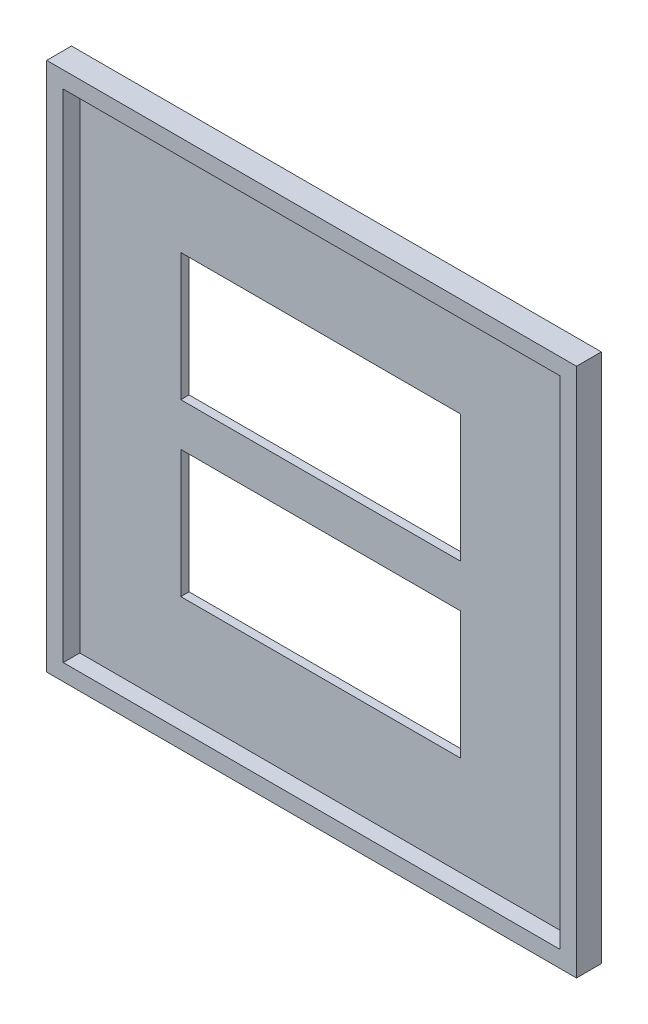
ISO-10303-21;
HEADER;
FILE_DESCRIPTION(('STEP AP214'),'2;1');
FILE_NAME('part.step','',(''),(''),'','','');
FILE_SCHEMA(('AUTOMOTIVE_DESIGN { 1 0 10303 214 1 1 1 1 }'));
ENDSEC;
DATA;
#1=APPLICATION_CONTEXT('core data for automotive mechanical design processes');
#2=APPLICATION_PROTOCOL_DEFINITION('international standard','automotive_design',2000,#1);
#3=PRODUCT_CONTEXT('',#1,'mechanical');
#4=PRODUCT('Part','Part','',(#3));
#5=PRODUCT_RELATED_PRODUCT_CATEGORY('part','',(#4));
#6=PRODUCT_DEFINITION_FORMATION('','',#4);
#7=PRODUCT_DEFINITION_CONTEXT('part definition',#1,'design');
#8=PRODUCT_DEFINITION('design','',#6,#7);
#9=PRODUCT_DEFINITION_SHAPE('','',#8);
#10=(LENGTH_UNIT() NAMED_UNIT(*) SI_UNIT(.MILLI.,.METRE.));
#11=(NAMED_UNIT(*) PLANE_ANGLE_UNIT() SI_UNIT($,.RADIAN.));
#12=(NAMED_UNIT(*) SI_UNIT($,.STERADIAN.) SOLID_ANGLE_UNIT());
#13=UNCERTAINTY_MEASURE_WITH_UNIT(LENGTH_MEASURE(1.E-05),#10,'distance_accuracy_value','');
#14=(GEOMETRIC_REPRESENTATION_CONTEXT(3) GLOBAL_UNCERTAINTY_ASSIGNED_CONTEXT((#13)) GLOBAL_UNIT_ASSIGNED_CONTEXT((#10,
#11,#12)) REPRESENTATION_CONTEXT('',''));
#15=CARTESIAN_POINT('',(0.,0.,0.));
#16=DIRECTION('',(0.,0.,1.));
#17=DIRECTION('',(1.,0.,0.));
#18=AXIS2_PLACEMENT_3D('',#15,#16,#17);
#19=CARTESIAN_POINT('',(40.64,-40.64,3.81));
#20=DIRECTION('',(-1.,0.,0.));
#21=DIRECTION('',(0.,0.,1.));
#22=AXIS2_PLACEMENT_3D('',#19,#20,#21);
#23=PLANE('',#22);
#24=DIRECTION('',(0.,1.,0.));
#25=VECTOR('',#24,1.);
#26=CARTESIAN_POINT('',(40.64,-40.64,0.));
#27=LINE('',#26,#25);
#28=CARTESIAN_POINT('',(40.64,-40.64,0.));
#29=VERTEX_POINT('',#28);
#30=CARTESIAN_POINT('',(40.64,40.64,0.));
#31=VERTEX_POINT('',#30);
#32=EDGE_CURVE('E228',#29,#31,#27,.T.);
#33=ORIENTED_EDGE('',*,*,#32,.T.);
#34=DIRECTION('',(0.,0.,-1.));
#35=VECTOR('',#34,1.);
#36=CARTESIAN_POINT('',(40.64,40.64,3.81));
#37=LINE('',#36,#35);
#38=CARTESIAN_POINT('',(40.64,40.64,3.81));
#39=VERTEX_POINT('',#38);
#40=EDGE_CURVE('E261',#39,#31,#37,.T.);
#41=ORIENTED_EDGE('',*,*,#40,.F.);
#42=DIRECTION('',(0.,1.,0.));
#43=VECTOR('',#42,1.);
#44=CARTESIAN_POINT('',(40.64,-40.64,3.81));
#45=LINE('',#44,#43);
#46=CARTESIAN_POINT('',(40.64,-40.64,3.81));
#47=VERTEX_POINT('',#46);
#48=EDGE_CURVE('E235',#47,#39,#45,.T.);
#49=ORIENTED_EDGE('',*,*,#48,.F.);
#50=DIRECTION('',(0.,0.,-1.));
#51=VECTOR('',#50,1.);
#52=CARTESIAN_POINT('',(40.64,-40.64,3.81));
#53=LINE('',#52,#51);
#54=EDGE_CURVE('E245',#47,#29,#53,.T.);
#55=ORIENTED_EDGE('',*,*,#54,.T.);
#56=EDGE_LOOP('',(#33,#41,#49,#55));
#57=FACE_BOUND('',#56,.T.);
#58=ADVANCED_FACE('F39',(#57),#23,.F.);
#59=CARTESIAN_POINT('',(-40.64,40.64,3.81));
#60=DIRECTION('',(0.,-1.,0.));
#61=DIRECTION('',(0.,0.,-1.));
#62=AXIS2_PLACEMENT_3D('',#59,#60,#61);
#63=PLANE('',#62);
#64=DIRECTION('',(-1.,0.,0.));
#65=VECTOR('',#64,1.);
#66=CARTESIAN_POINT('',(-40.64,40.64,0.));
#67=LINE('',#66,#65);
#68=CARTESIAN_POINT('',(-40.64,40.64,0.));
#69=VERTEX_POINT('',#68);
#70=EDGE_CURVE('E248',#31,#69,#67,.T.);
#71=ORIENTED_EDGE('',*,*,#70,.T.);
#72=DIRECTION('',(0.,0.,-1.));
#73=VECTOR('',#72,1.);
#74=CARTESIAN_POINT('',(-40.64,40.64,3.81));
#75=LINE('',#74,#73);
#76=CARTESIAN_POINT('',(-40.64,40.64,3.81));
#77=VERTEX_POINT('',#76);
#78=EDGE_CURVE('E258',#77,#69,#75,.T.);
#79=ORIENTED_EDGE('',*,*,#78,.F.);
#80=DIRECTION('',(-1.,0.,0.));
#81=VECTOR('',#80,1.);
#82=CARTESIAN_POINT('',(-40.64,40.64,3.81));
#83=LINE('',#82,#81);
#84=EDGE_CURVE('E238',#39,#77,#83,.T.);
#85=ORIENTED_EDGE('',*,*,#84,.F.);
#86=ORIENTED_EDGE('',*,*,#40,.T.);
#87=EDGE_LOOP('',(#71,#79,#85,#86));
#88=FACE_BOUND('',#87,.T.);
#89=ADVANCED_FACE('F300',(#88),#63,.F.);
#90=CARTESIAN_POINT('',(-40.64,-40.64,3.81));
#91=DIRECTION('',(1.,0.,0.));
#92=DIRECTION('',(0.,0.,-1.));
#93=AXIS2_PLACEMENT_3D('',#90,#91,#92);
#94=PLANE('',#93);
#95=DIRECTION('',(0.,-1.,0.));
#96=VECTOR('',#95,1.);
#97=CARTESIAN_POINT('',(-40.64,-40.64,0.));
#98=LINE('',#97,#96);
#99=CARTESIAN_POINT('',(-40.64,-40.64,0.));
#100=VERTEX_POINT('',#99);
#101=EDGE_CURVE('E250',#69,#100,#98,.T.);
#102=ORIENTED_EDGE('',*,*,#101,.T.);
#103=DIRECTION('',(0.,0.,-1.));
#104=VECTOR('',#103,1.);
#105=CARTESIAN_POINT('',(-40.64,-40.64,3.81));
#106=LINE('',#105,#104);
#107=CARTESIAN_POINT('',(-40.64,-40.64,3.81));
#108=VERTEX_POINT('',#107);
#109=EDGE_CURVE('E255',#108,#100,#106,.T.);
#110=ORIENTED_EDGE('',*,*,#109,.F.);
#111=DIRECTION('',(0.,-1.,0.));
#112=VECTOR('',#111,1.);
#113=CARTESIAN_POINT('',(-40.64,-40.64,3.81));
#114=LINE('',#113,#112);
#115=EDGE_CURVE('E241',#77,#108,#114,.T.);
#116=ORIENTED_EDGE('',*,*,#115,.F.);
#117=ORIENTED_EDGE('',*,*,#78,.T.);
#118=EDGE_LOOP('',(#102,#110,#116,#117));
#119=FACE_BOUND('',#118,.T.);
#120=ADVANCED_FACE('F305',(#119),#94,.F.);
#121=CARTESIAN_POINT('',(-40.64,-40.64,3.81));
#122=DIRECTION('',(0.,1.,0.));
#123=DIRECTION('',(0.,0.,1.));
#124=AXIS2_PLACEMENT_3D('',#121,#122,#123);
#125=PLANE('',#124);
#126=DIRECTION('',(1.,0.,0.));
#127=VECTOR('',#126,1.);
#128=CARTESIAN_POINT('',(-40.64,-40.64,0.));
#129=LINE('',#128,#127);
#130=EDGE_CURVE('E239',#100,#29,#129,.T.);
#131=ORIENTED_EDGE('',*,*,#130,.T.);
#132=ORIENTED_EDGE('',*,*,#54,.F.);
#133=DIRECTION('',(1.,0.,0.));
#134=VECTOR('',#133,1.);
#135=CARTESIAN_POINT('',(-40.64,-40.64,3.81));
#136=LINE('',#135,#134);
#137=EDGE_CURVE('E243',#108,#47,#136,.T.);
#138=ORIENTED_EDGE('',*,*,#137,.F.);
#139=ORIENTED_EDGE('',*,*,#109,.T.);
#140=EDGE_LOOP('',(#131,#132,#138,#139));
#141=FACE_BOUND('',#140,.T.);
#142=ADVANCED_FACE('F321',(#141),#125,.F.);
#143=CARTESIAN_POINT('',(0.,0.,3.81));
#144=DIRECTION('',(0.,0.,-1.));
#145=DIRECTION('',(-1.,0.,0.));
#146=AXIS2_PLACEMENT_3D('',#143,#144,#145);
#147=PLANE('',#146);
#148=DIRECTION('',(-1.,0.,0.));
#149=VECTOR('',#148,1.);
#150=CARTESIAN_POINT('',(-38.1,38.1,3.81));
#151=LINE('',#150,#149);
#152=CARTESIAN_POINT('',(38.1,38.1,3.81));
#153=VERTEX_POINT('',#152);
#154=CARTESIAN_POINT('',(-38.1,38.1,3.81));
#155=VERTEX_POINT('',#154);
#156=EDGE_CURVE('E218',#153,#155,#151,.T.);
#157=ORIENTED_EDGE('',*,*,#156,.F.);
#158=DIRECTION('',(0.,1.,0.));
#159=VECTOR('',#158,1.);
#160=CARTESIAN_POINT('',(38.1,-38.1,3.81));
#161=LINE('',#160,#159);
#162=CARTESIAN_POINT('',(38.1,-38.1,3.81));
#163=VERTEX_POINT('',#162);
#164=EDGE_CURVE('E182',#163,#153,#161,.T.);
#165=ORIENTED_EDGE('',*,*,#164,.F.);
#166=DIRECTION('',(1.,0.,0.));
#167=VECTOR('',#166,1.);
#168=CARTESIAN_POINT('',(-38.1,-38.1,3.81));
#169=LINE('',#168,#167);
#170=CARTESIAN_POINT('',(-38.1,-38.1,3.81));
#171=VERTEX_POINT('',#170);
#172=EDGE_CURVE('E207',#171,#163,#169,.T.);
#173=ORIENTED_EDGE('',*,*,#172,.F.);
#174=DIRECTION('',(0.,-1.,0.));
#175=VECTOR('',#174,1.);
#176=CARTESIAN_POINT('',(-38.1,-38.1,3.81));
#177=LINE('',#176,#175);
#178=EDGE_CURVE('E221',#155,#171,#177,.T.);
#179=ORIENTED_EDGE('',*,*,#178,.F.);
#180=EDGE_LOOP('',(#157,#165,#173,#179));
#181=FACE_BOUND('',#180,.T.);
#182=ORIENTED_EDGE('',*,*,#48,.T.);
#183=ORIENTED_EDGE('',*,*,#84,.T.);
#184=ORIENTED_EDGE('',*,*,#115,.T.);
#185=ORIENTED_EDGE('',*,*,#137,.T.);
#186=EDGE_LOOP('',(#182,#183,#184,#185));
#187=FACE_BOUND('',#186,.T.);
#188=ADVANCED_FACE('F317',(#181,#187),#147,.F.);
#189=CARTESIAN_POINT('',(0.,0.,0.));
#190=DIRECTION('',(0.,0.,-1.));
#191=DIRECTION('',(-1.,0.,0.));
#192=AXIS2_PLACEMENT_3D('',#189,#190,#191);
#193=PLANE('',#192);
#194=DIRECTION('',(0.,1.,0.));
#195=VECTOR('',#194,1.);
#196=CARTESIAN_POINT('',(-22.606,22.86,0.));
#197=LINE('',#196,#195);
#198=CARTESIAN_POINT('',(-22.606,3.30200000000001,0.));
#199=VERTEX_POINT('',#198);
#200=CARTESIAN_POINT('',(-22.606,22.86,0.));
#201=VERTEX_POINT('',#200);
#202=EDGE_CURVE('E53',#199,#201,#197,.T.);
#203=ORIENTED_EDGE('',*,*,#202,.F.);
#204=DIRECTION('',(-1.,0.,0.));
#205=VECTOR('',#204,1.);
#206=CARTESIAN_POINT('',(20.32,3.30200000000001,0.));
#207=LINE('',#206,#205);
#208=CARTESIAN_POINT('',(20.32,3.30200000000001,0.));
#209=VERTEX_POINT('',#208);
#210=EDGE_CURVE('E175',#209,#199,#207,.T.);
#211=ORIENTED_EDGE('',*,*,#210,.F.);
#212=DIRECTION('',(0.,-1.,0.));
#213=VECTOR('',#212,1.);
#214=CARTESIAN_POINT('',(20.32,22.86,0.));
#215=LINE('',#214,#213);
#216=CARTESIAN_POINT('',(20.32,22.86,0.));
#217=VERTEX_POINT('',#216);
#218=EDGE_CURVE('E158',#217,#209,#215,.T.);
#219=ORIENTED_EDGE('',*,*,#218,.F.);
#220=DIRECTION('',(1.,0.,0.));
#221=VECTOR('',#220,1.);
#222=CARTESIAN_POINT('',(20.32,22.86,0.));
#223=LINE('',#222,#221);
#224=EDGE_CURVE('E168',#201,#217,#223,.T.);
#225=ORIENTED_EDGE('',*,*,#224,.F.);
#226=EDGE_LOOP('',(#203,#211,#219,#225));
#227=FACE_BOUND('',#226,.T.);
#228=DIRECTION('',(0.,1.,0.));
#229=VECTOR('',#228,1.);
#230=CARTESIAN_POINT('',(-22.606,-3.30200000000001,0.));
#231=LINE('',#230,#229);
#232=CARTESIAN_POINT('',(-22.606,-22.86,0.));
#233=VERTEX_POINT('',#232);
#234=CARTESIAN_POINT('',(-22.606,-3.30200000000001,0.));
#235=VERTEX_POINT('',#234);
#236=EDGE_CURVE('E61',#233,#235,#231,.T.);
#237=ORIENTED_EDGE('',*,*,#236,.F.);
#238=DIRECTION('',(-1.,0.,0.));
#239=VECTOR('',#238,1.);
#240=CARTESIAN_POINT('',(20.32,-22.86,0.));
#241=LINE('',#240,#239);
#242=CARTESIAN_POINT('',(20.32,-22.86,0.));
#243=VERTEX_POINT('',#242);
#244=EDGE_CURVE('E192',#243,#233,#241,.T.);
#245=ORIENTED_EDGE('',*,*,#244,.F.);
#246=DIRECTION('',(0.,-1.,0.));
#247=VECTOR('',#246,1.);
#248=CARTESIAN_POINT('',(20.32,-3.30200000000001,0.));
#249=LINE('',#248,#247);
#250=CARTESIAN_POINT('',(20.32,-3.30200000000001,0.));
#251=VERTEX_POINT('',#250);
#252=EDGE_CURVE('E189',#251,#243,#249,.T.);
#253=ORIENTED_EDGE('',*,*,#252,.F.);
#254=DIRECTION('',(1.,0.,0.));
#255=VECTOR('',#254,1.);
#256=CARTESIAN_POINT('',(20.32,-3.30200000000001,0.));
#257=LINE('',#256,#255);
#258=EDGE_CURVE('E186',#235,#251,#257,.T.);
#259=ORIENTED_EDGE('',*,*,#258,.F.);
#260=EDGE_LOOP('',(#237,#245,#253,#259));
#261=FACE_BOUND('',#260,.T.);
#262=ORIENTED_EDGE('',*,*,#32,.F.);
#263=ORIENTED_EDGE('',*,*,#130,.F.);
#264=ORIENTED_EDGE('',*,*,#101,.F.);
#265=ORIENTED_EDGE('',*,*,#70,.F.);
#266=EDGE_LOOP('',(#262,#263,#264,#265));
#267=FACE_BOUND('',#266,.T.);
#268=ADVANCED_FACE('F172',(#227,#261,#267),#193,.T.);
#269=CARTESIAN_POINT('',(38.1,-38.1,1.27));
#270=DIRECTION('',(1.,0.,0.));
#271=DIRECTION('',(0.,0.,-1.));
#272=AXIS2_PLACEMENT_3D('',#269,#270,#271);
#273=PLANE('',#272);
#274=ORIENTED_EDGE('',*,*,#164,.T.);
#275=DIRECTION('',(0.,0.,1.));
#276=VECTOR('',#275,1.);
#277=CARTESIAN_POINT('',(38.1,38.1,1.27));
#278=LINE('',#277,#276);
#279=CARTESIAN_POINT('',(38.1,38.1,1.27));
#280=VERTEX_POINT('',#279);
#281=EDGE_CURVE('E216',#280,#153,#278,.T.);
#282=ORIENTED_EDGE('',*,*,#281,.F.);
#283=DIRECTION('',(0.,1.,0.));
#284=VECTOR('',#283,1.);
#285=CARTESIAN_POINT('',(38.1,-38.1,1.27));
#286=LINE('',#285,#284);
#287=CARTESIAN_POINT('',(38.1,-38.1,1.27));
#288=VERTEX_POINT('',#287);
#289=EDGE_CURVE('E203',#288,#280,#286,.T.);
#290=ORIENTED_EDGE('',*,*,#289,.F.);
#291=DIRECTION('',(0.,0.,1.));
#292=VECTOR('',#291,1.);
#293=CARTESIAN_POINT('',(38.1,-38.1,1.27));
#294=LINE('',#293,#292);
#295=EDGE_CURVE('E226',#288,#163,#294,.T.);
#296=ORIENTED_EDGE('',*,*,#295,.T.);
#297=EDGE_LOOP('',(#274,#282,#290,#296));
#298=FACE_BOUND('',#297,.T.);
#299=ADVANCED_FACE('F332',(#298),#273,.F.);
#300=CARTESIAN_POINT('',(-38.1,-38.1,1.27));
#301=DIRECTION('',(0.,-1.,0.));
#302=DIRECTION('',(0.,0.,-1.));
#303=AXIS2_PLACEMENT_3D('',#300,#301,#302);
#304=PLANE('',#303);
#305=ORIENTED_EDGE('',*,*,#172,.T.);
#306=ORIENTED_EDGE('',*,*,#295,.F.);
#307=DIRECTION('',(1.,0.,0.));
#308=VECTOR('',#307,1.);
#309=CARTESIAN_POINT('',(-38.1,-38.1,1.27));
#310=LINE('',#309,#308);
#311=CARTESIAN_POINT('',(-38.1,-38.1,1.27));
#312=VERTEX_POINT('',#311);
#313=EDGE_CURVE('E213',#312,#288,#310,.T.);
#314=ORIENTED_EDGE('',*,*,#313,.F.);
#315=DIRECTION('',(0.,0.,1.));
#316=VECTOR('',#315,1.);
#317=CARTESIAN_POINT('',(-38.1,-38.1,1.27));
#318=LINE('',#317,#316);
#319=EDGE_CURVE('E229',#312,#171,#318,.T.);
#320=ORIENTED_EDGE('',*,*,#319,.T.);
#321=EDGE_LOOP('',(#305,#306,#314,#320));
#322=FACE_BOUND('',#321,.T.);
#323=ADVANCED_FACE('F338',(#322),#304,.F.);
#324=CARTESIAN_POINT('',(-38.1,-38.1,1.27));
#325=DIRECTION('',(-1.,0.,0.));
#326=DIRECTION('',(0.,0.,1.));
#327=AXIS2_PLACEMENT_3D('',#324,#325,#326);
#328=PLANE('',#327);
#329=ORIENTED_EDGE('',*,*,#178,.T.);
#330=ORIENTED_EDGE('',*,*,#319,.F.);
#331=DIRECTION('',(0.,-1.,0.));
#332=VECTOR('',#331,1.);
#333=CARTESIAN_POINT('',(-38.1,-38.1,1.27));
#334=LINE('',#333,#332);
#335=CARTESIAN_POINT('',(-38.1,38.1,1.27));
#336=VERTEX_POINT('',#335);
#337=EDGE_CURVE('E210',#336,#312,#334,.T.);
#338=ORIENTED_EDGE('',*,*,#337,.F.);
#339=DIRECTION('',(0.,0.,1.));
#340=VECTOR('',#339,1.);
#341=CARTESIAN_POINT('',(-38.1,38.1,1.27));
#342=LINE('',#341,#340);
#343=EDGE_CURVE('E231',#336,#155,#342,.T.);
#344=ORIENTED_EDGE('',*,*,#343,.T.);
#345=EDGE_LOOP('',(#329,#330,#338,#344));
#346=FACE_BOUND('',#345,.T.);
#347=ADVANCED_FACE('F343',(#346),#328,.F.);
#348=CARTESIAN_POINT('',(-38.1,38.1,1.27));
#349=DIRECTION('',(0.,1.,0.));
#350=DIRECTION('',(0.,0.,1.));
#351=AXIS2_PLACEMENT_3D('',#348,#349,#350);
#352=PLANE('',#351);
#353=ORIENTED_EDGE('',*,*,#156,.T.);
#354=ORIENTED_EDGE('',*,*,#343,.F.);
#355=DIRECTION('',(-1.,0.,0.));
#356=VECTOR('',#355,1.);
#357=CARTESIAN_POINT('',(-38.1,38.1,1.27));
#358=LINE('',#357,#356);
#359=EDGE_CURVE('E206',#280,#336,#358,.T.);
#360=ORIENTED_EDGE('',*,*,#359,.F.);
#361=ORIENTED_EDGE('',*,*,#281,.T.);
#362=EDGE_LOOP('',(#353,#354,#360,#361));
#363=FACE_BOUND('',#362,.T.);
#364=ADVANCED_FACE('F340',(#363),#352,.F.);
#365=CARTESIAN_POINT('',(0.,0.,1.27));
#366=DIRECTION('',(0.,0.,-1.));
#367=DIRECTION('',(-1.,0.,0.));
#368=AXIS2_PLACEMENT_3D('',#365,#366,#367);
#369=PLANE('',#368);
#370=DIRECTION('',(-1.,0.,0.));
#371=VECTOR('',#370,1.);
#372=CARTESIAN_POINT('',(0.,3.30200000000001,1.27));
#373=LINE('',#372,#371);
#374=CARTESIAN_POINT('',(20.32,3.30200000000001,1.27));
#375=VERTEX_POINT('',#374);
#376=CARTESIAN_POINT('',(-22.606,3.30200000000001,1.27));
#377=VERTEX_POINT('',#376);
#378=EDGE_CURVE('E46',#375,#377,#373,.T.);
#379=ORIENTED_EDGE('',*,*,#378,.T.);
#380=DIRECTION('',(0.,1.,0.));
#381=VECTOR('',#380,1.);
#382=CARTESIAN_POINT('',(-22.606,0.,1.27));
#383=LINE('',#382,#381);
#384=CARTESIAN_POINT('',(-22.606,22.86,1.27));
#385=VERTEX_POINT('',#384);
#386=EDGE_CURVE('E11',#377,#385,#383,.T.);
#387=ORIENTED_EDGE('',*,*,#386,.T.);
#388=DIRECTION('',(1.,0.,0.));
#389=VECTOR('',#388,1.);
#390=CARTESIAN_POINT('',(0.,22.86,1.27));
#391=LINE('',#390,#389);
#392=CARTESIAN_POINT('',(20.32,22.86,1.27));
#393=VERTEX_POINT('',#392);
#394=EDGE_CURVE('E276',#385,#393,#391,.T.);
#395=ORIENTED_EDGE('',*,*,#394,.T.);
#396=DIRECTION('',(0.,-1.,0.));
#397=VECTOR('',#396,1.);
#398=CARTESIAN_POINT('',(20.32,0.,1.27));
#399=LINE('',#398,#397);
#400=EDGE_CURVE('E161',#393,#375,#399,.T.);
#401=ORIENTED_EDGE('',*,*,#400,.T.);
#402=EDGE_LOOP('',(#379,#387,#395,#401));
#403=FACE_BOUND('',#402,.T.);
#404=DIRECTION('',(-1.,0.,0.));
#405=VECTOR('',#404,1.);
#406=CARTESIAN_POINT('',(0.,-22.86,1.27));
#407=LINE('',#406,#405);
#408=CARTESIAN_POINT('',(20.32,-22.86,1.27));
#409=VERTEX_POINT('',#408);
#410=CARTESIAN_POINT('',(-22.606,-22.86,1.27));
#411=VERTEX_POINT('',#410);
#412=EDGE_CURVE('E270',#409,#411,#407,.T.);
#413=ORIENTED_EDGE('',*,*,#412,.T.);
#414=DIRECTION('',(0.,1.,0.));
#415=VECTOR('',#414,1.);
#416=CARTESIAN_POINT('',(-22.606,0.,1.27));
#417=LINE('',#416,#415);
#418=CARTESIAN_POINT('',(-22.606,-3.30200000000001,1.27));
#419=VERTEX_POINT('',#418);
#420=EDGE_CURVE('E273',#411,#419,#417,.T.);
#421=ORIENTED_EDGE('',*,*,#420,.T.);
#422=DIRECTION('',(1.,0.,0.));
#423=VECTOR('',#422,1.);
#424=CARTESIAN_POINT('',(0.,-3.30200000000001,1.27));
#425=LINE('',#424,#423);
#426=CARTESIAN_POINT('',(20.32,-3.30200000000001,1.27));
#427=VERTEX_POINT('',#426);
#428=EDGE_CURVE('E264',#419,#427,#425,.T.);
#429=ORIENTED_EDGE('',*,*,#428,.T.);
#430=DIRECTION('',(0.,-1.,0.));
#431=VECTOR('',#430,1.);
#432=CARTESIAN_POINT('',(20.32,0.,1.27));
#433=LINE('',#432,#431);
#434=EDGE_CURVE('E267',#427,#409,#433,.T.);
#435=ORIENTED_EDGE('',*,*,#434,.T.);
#436=EDGE_LOOP('',(#413,#421,#429,#435));
#437=FACE_BOUND('',#436,.T.);
#438=ORIENTED_EDGE('',*,*,#289,.T.);
#439=ORIENTED_EDGE('',*,*,#359,.T.);
#440=ORIENTED_EDGE('',*,*,#337,.T.);
#441=ORIENTED_EDGE('',*,*,#313,.T.);
#442=EDGE_LOOP('',(#438,#439,#440,#441));
#443=FACE_BOUND('',#442,.T.);
#444=ADVANCED_FACE('F280',(#403,#437,#443),#369,.F.);
#445=CARTESIAN_POINT('',(-22.606,-3.30200000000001,3.81));
#446=DIRECTION('',(-1.,0.,0.));
#447=DIRECTION('',(0.,0.,1.));
#448=AXIS2_PLACEMENT_3D('',#445,#446,#447);
#449=PLANE('',#448);
#450=DIRECTION('',(0.,0.,-1.));
#451=VECTOR('',#450,1.);
#452=CARTESIAN_POINT('',(-22.606,-22.86,3.81));
#453=LINE('',#452,#451);
#454=EDGE_CURVE('E196',#411,#233,#453,.T.);
#455=ORIENTED_EDGE('',*,*,#454,.T.);
#456=ORIENTED_EDGE('',*,*,#236,.T.);
#457=DIRECTION('',(0.,0.,-1.));
#458=VECTOR('',#457,1.);
#459=CARTESIAN_POINT('',(-22.606,-3.30200000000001,3.81));
#460=LINE('',#459,#458);
#461=EDGE_CURVE('E195',#419,#235,#460,.T.);
#462=ORIENTED_EDGE('',*,*,#461,.F.);
#463=ORIENTED_EDGE('',*,*,#420,.F.);
#464=EDGE_LOOP('',(#455,#456,#462,#463));
#465=FACE_BOUND('',#464,.T.);
#466=ADVANCED_FACE('F353',(#465),#449,.F.);
#467=CARTESIAN_POINT('',(20.32,-22.86,3.81));
#468=DIRECTION('',(0.,-1.,0.));
#469=DIRECTION('',(0.,0.,-1.));
#470=AXIS2_PLACEMENT_3D('',#467,#468,#469);
#471=PLANE('',#470);
#472=DIRECTION('',(0.,0.,-1.));
#473=VECTOR('',#472,1.);
#474=CARTESIAN_POINT('',(20.32,-22.86,3.81));
#475=LINE('',#474,#473);
#476=EDGE_CURVE('E198',#409,#243,#475,.T.);
#477=ORIENTED_EDGE('',*,*,#476,.T.);
#478=ORIENTED_EDGE('',*,*,#244,.T.);
#479=ORIENTED_EDGE('',*,*,#454,.F.);
#480=ORIENTED_EDGE('',*,*,#412,.F.);
#481=EDGE_LOOP('',(#477,#478,#479,#480));
#482=FACE_BOUND('',#481,.T.);
#483=ADVANCED_FACE('F355',(#482),#471,.F.);
#484=CARTESIAN_POINT('',(20.32,-3.30200000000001,3.81));
#485=DIRECTION('',(1.,0.,0.));
#486=DIRECTION('',(0.,1.,0.));
#487=AXIS2_PLACEMENT_3D('',#484,#485,#486);
#488=PLANE('',#487);
#489=DIRECTION('',(0.,0.,-1.));
#490=VECTOR('',#489,1.);
#491=CARTESIAN_POINT('',(20.32,-3.30200000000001,3.81));
#492=LINE('',#491,#490);
#493=EDGE_CURVE('E200',#427,#251,#492,.T.);
#494=ORIENTED_EDGE('',*,*,#493,.T.);
#495=ORIENTED_EDGE('',*,*,#252,.T.);
#496=ORIENTED_EDGE('',*,*,#476,.F.);
#497=ORIENTED_EDGE('',*,*,#434,.F.);
#498=EDGE_LOOP('',(#494,#495,#496,#497));
#499=FACE_BOUND('',#498,.T.);
#500=ADVANCED_FACE('F294',(#499),#488,.F.);
#501=CARTESIAN_POINT('',(20.32,-3.30200000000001,3.81));
#502=DIRECTION('',(0.,1.,0.));
#503=DIRECTION('',(0.,0.,1.));
#504=AXIS2_PLACEMENT_3D('',#501,#502,#503);
#505=PLANE('',#504);
#506=ORIENTED_EDGE('',*,*,#461,.T.);
#507=ORIENTED_EDGE('',*,*,#258,.T.);
#508=ORIENTED_EDGE('',*,*,#493,.F.);
#509=ORIENTED_EDGE('',*,*,#428,.F.);
#510=EDGE_LOOP('',(#506,#507,#508,#509));
#511=FACE_BOUND('',#510,.T.);
#512=ADVANCED_FACE('F287',(#511),#505,.F.);
#513=CARTESIAN_POINT('',(-22.606,22.86,3.81));
#514=DIRECTION('',(-1.,0.,0.));
#515=DIRECTION('',(0.,-1.,0.));
#516=AXIS2_PLACEMENT_3D('',#513,#514,#515);
#517=PLANE('',#516);
#518=DIRECTION('',(0.,0.,-1.));
#519=VECTOR('',#518,1.);
#520=CARTESIAN_POINT('',(-22.606,3.30200000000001,3.81));
#521=LINE('',#520,#519);
#522=EDGE_CURVE('E180',#377,#199,#521,.T.);
#523=ORIENTED_EDGE('',*,*,#522,.T.);
#524=ORIENTED_EDGE('',*,*,#202,.T.);
#525=DIRECTION('',(0.,0.,-1.));
#526=VECTOR('',#525,1.);
#527=CARTESIAN_POINT('',(-22.606,22.86,3.81));
#528=LINE('',#527,#526);
#529=EDGE_CURVE('E165',#385,#201,#528,.T.);
#530=ORIENTED_EDGE('',*,*,#529,.F.);
#531=ORIENTED_EDGE('',*,*,#386,.F.);
#532=EDGE_LOOP('',(#523,#524,#530,#531));
#533=FACE_BOUND('',#532,.T.);
#534=ADVANCED_FACE('F285',(#533),#517,.F.);
#535=CARTESIAN_POINT('',(20.32,3.30200000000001,3.81));
#536=DIRECTION('',(0.,-1.,0.));
#537=DIRECTION('',(0.,0.,-1.));
#538=AXIS2_PLACEMENT_3D('',#535,#536,#537);
#539=PLANE('',#538);
#540=DIRECTION('',(0.,0.,-1.));
#541=VECTOR('',#540,1.);
#542=CARTESIAN_POINT('',(20.32,3.30200000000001,3.81));
#543=LINE('',#542,#541);
#544=EDGE_CURVE('E164',#375,#209,#543,.T.);
#545=ORIENTED_EDGE('',*,*,#544,.T.);
#546=ORIENTED_EDGE('',*,*,#210,.T.);
#547=ORIENTED_EDGE('',*,*,#522,.F.);
#548=ORIENTED_EDGE('',*,*,#378,.F.);
#549=EDGE_LOOP('',(#545,#546,#547,#548));
#550=FACE_BOUND('',#549,.T.);
#551=ADVANCED_FACE('F284',(#550),#539,.F.);
#552=CARTESIAN_POINT('',(20.32,22.86,3.81));
#553=DIRECTION('',(1.,0.,0.));
#554=DIRECTION('',(0.,0.,-1.));
#555=AXIS2_PLACEMENT_3D('',#552,#553,#554);
#556=PLANE('',#555);
#557=DIRECTION('',(0.,0.,-1.));
#558=VECTOR('',#557,1.);
#559=CARTESIAN_POINT('',(20.32,22.86,3.81));
#560=LINE('',#559,#558);
#561=EDGE_CURVE('E153',#393,#217,#560,.T.);
#562=ORIENTED_EDGE('',*,*,#561,.T.);
#563=ORIENTED_EDGE('',*,*,#218,.T.);
#564=ORIENTED_EDGE('',*,*,#544,.F.);
#565=ORIENTED_EDGE('',*,*,#400,.F.);
#566=EDGE_LOOP('',(#562,#563,#564,#565));
#567=FACE_BOUND('',#566,.T.);
#568=ADVANCED_FACE('F155',(#567),#556,.F.);
#569=CARTESIAN_POINT('',(20.32,22.86,3.81));
#570=DIRECTION('',(0.,1.,0.));
#571=DIRECTION('',(0.,0.,1.));
#572=AXIS2_PLACEMENT_3D('',#569,#570,#571);
#573=PLANE('',#572);
#574=ORIENTED_EDGE('',*,*,#529,.T.);
#575=ORIENTED_EDGE('',*,*,#224,.T.);
#576=ORIENTED_EDGE('',*,*,#561,.F.);
#577=ORIENTED_EDGE('',*,*,#394,.F.);
#578=EDGE_LOOP('',(#574,#575,#576,#577));
#579=FACE_BOUND('',#578,.T.);
#580=ADVANCED_FACE('F169',(#579),#573,.F.);
#581=CLOSED_SHELL('',(#58,#89,#120,#142,#188,#268,#299,#323,#347,#364,#444,#466,#483,#500,#512,
#534,#551,#568,#580));
#582=MANIFOLD_SOLID_BREP('B2',#581);
#583=ADVANCED_BREP_SHAPE_REPRESENTATION('',(#18,#582),#14);
#584=SHAPE_DEFINITION_REPRESENTATION(#9,#583);
ENDSEC;
END-ISO-10303-21;
